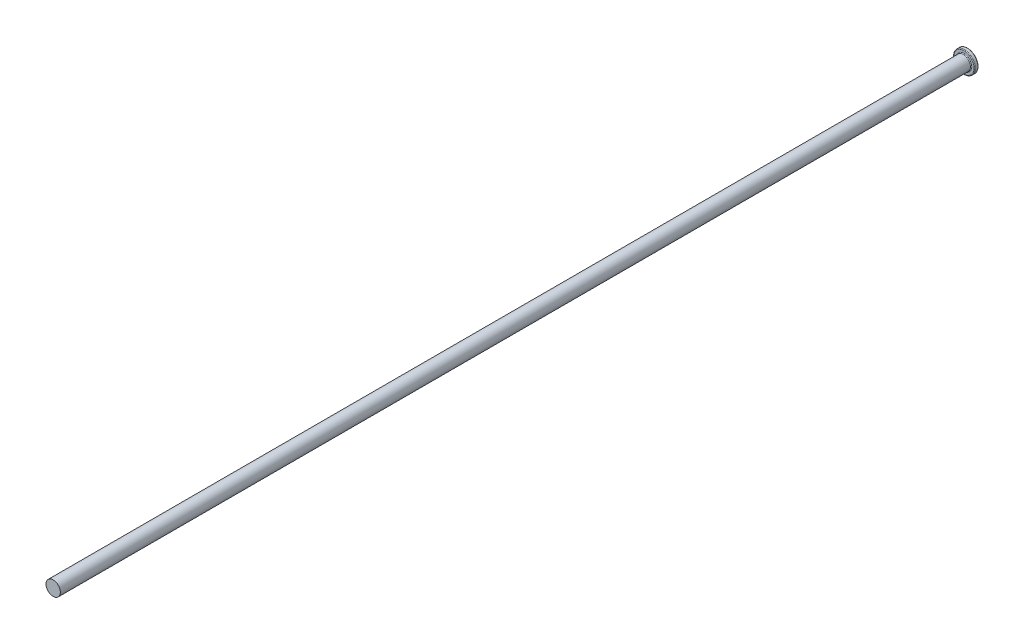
ISO-10303-21;
HEADER;
FILE_DESCRIPTION(('STEP AP214'),'2;1');
FILE_NAME('part.step','',(''),(''),'','','');
FILE_SCHEMA(('AUTOMOTIVE_DESIGN { 1 0 10303 214 1 1 1 1 }'));
ENDSEC;
DATA;
#1=APPLICATION_CONTEXT('core data for automotive mechanical design processes');
#2=APPLICATION_PROTOCOL_DEFINITION('international standard','automotive_design',2000,#1);
#3=PRODUCT_CONTEXT('',#1,'mechanical');
#4=PRODUCT('Part','Part','',(#3));
#5=PRODUCT_RELATED_PRODUCT_CATEGORY('part','',(#4));
#6=PRODUCT_DEFINITION_FORMATION('','',#4);
#7=PRODUCT_DEFINITION_CONTEXT('part definition',#1,'design');
#8=PRODUCT_DEFINITION('design','',#6,#7);
#9=PRODUCT_DEFINITION_SHAPE('','',#8);
#10=(LENGTH_UNIT() NAMED_UNIT(*) SI_UNIT(.MILLI.,.METRE.));
#11=(NAMED_UNIT(*) PLANE_ANGLE_UNIT() SI_UNIT($,.RADIAN.));
#12=(NAMED_UNIT(*) SI_UNIT($,.STERADIAN.) SOLID_ANGLE_UNIT());
#13=UNCERTAINTY_MEASURE_WITH_UNIT(LENGTH_MEASURE(1.E-05),#10,'distance_accuracy_value','');
#14=(GEOMETRIC_REPRESENTATION_CONTEXT(3) GLOBAL_UNCERTAINTY_ASSIGNED_CONTEXT((#13)) GLOBAL_UNIT_ASSIGNED_CONTEXT((#10,
#11,#12)) REPRESENTATION_CONTEXT('',''));
#15=CARTESIAN_POINT('',(0.,0.,0.));
#16=DIRECTION('',(0.,0.,1.));
#17=DIRECTION('',(1.,0.,0.));
#18=AXIS2_PLACEMENT_3D('',#15,#16,#17);
#19=CARTESIAN_POINT('',(0.,0.,127.));
#20=DIRECTION('',(0.,0.,-1.));
#21=DIRECTION('',(-1.,0.,0.));
#22=AXIS2_PLACEMENT_3D('',#19,#20,#21);
#23=CYLINDRICAL_SURFACE('',#22,1.);
#24=CARTESIAN_POINT('',(0.,0.,0.099999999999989));
#25=DIRECTION('',(0.,0.,-1.));
#26=DIRECTION('',(-1.,0.,0.));
#27=AXIS2_PLACEMENT_3D('',#24,#25,#26);
#28=CIRCLE('',#27,1.);
#29=CARTESIAN_POINT('',(-1.,0.,0.099999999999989));
#30=VERTEX_POINT('',#29);
#31=EDGE_CURVE('E71',#30,#30,#28,.F.);
#32=ORIENTED_EDGE('',*,*,#31,.T.);
#33=EDGE_LOOP('',(#32));
#34=FACE_BOUND('',#33,.T.);
#35=CARTESIAN_POINT('',(0.,0.,127.));
#36=DIRECTION('',(0.,0.,1.));
#37=DIRECTION('',(1.,0.,0.));
#38=AXIS2_PLACEMENT_3D('',#35,#36,#37);
#39=CIRCLE('',#38,1.);
#40=CARTESIAN_POINT('',(1.,0.,127.));
#41=VERTEX_POINT('',#40);
#42=EDGE_CURVE('E75',#41,#41,#39,.T.);
#43=ORIENTED_EDGE('',*,*,#42,.F.);
#44=EDGE_LOOP('',(#43));
#45=FACE_BOUND('',#44,.T.);
#46=ADVANCED_FACE('F43',(#34,#45),#23,.T.);
#47=CARTESIAN_POINT('',(0.,0.,127.));
#48=DIRECTION('',(0.,0.,1.));
#49=DIRECTION('',(1.,0.,0.));
#50=AXIS2_PLACEMENT_3D('',#47,#48,#49);
#51=PLANE('',#50);
#52=ORIENTED_EDGE('',*,*,#42,.T.);
#53=EDGE_LOOP('',(#52));
#54=FACE_BOUND('',#53,.T.);
#55=ADVANCED_FACE('F80',(#54),#51,.T.);
#56=CARTESIAN_POINT('',(0.,0.,-0.5));
#57=DIRECTION('',(0.,0.,1.));
#58=DIRECTION('',(1.,0.,0.));
#59=AXIS2_PLACEMENT_3D('',#56,#57,#58);
#60=CYLINDRICAL_SURFACE('',#59,1.5);
#61=CARTESIAN_POINT('',(0.,0.,-0.45));
#62=DIRECTION('',(0.,0.,-1.));
#63=DIRECTION('',(-1.,0.,0.));
#64=AXIS2_PLACEMENT_3D('',#61,#62,#63);
#65=CIRCLE('',#64,1.5);
#66=CARTESIAN_POINT('',(-1.5,0.,-0.45));
#67=VERTEX_POINT('',#66);
#68=EDGE_CURVE('E10',#67,#67,#65,.F.);
#69=ORIENTED_EDGE('',*,*,#68,.T.);
#70=EDGE_LOOP('',(#69));
#71=FACE_BOUND('',#70,.T.);
#72=CARTESIAN_POINT('',(0.,0.,-0.1));
#73=DIRECTION('',(0.,0.,-1.));
#74=DIRECTION('',(-1.,0.,0.));
#75=AXIS2_PLACEMENT_3D('',#72,#73,#74);
#76=CIRCLE('',#75,1.5);
#77=CARTESIAN_POINT('',(-1.5,0.,-0.1));
#78=VERTEX_POINT('',#77);
#79=EDGE_CURVE('E61',#78,#78,#76,.T.);
#80=ORIENTED_EDGE('',*,*,#79,.T.);
#81=EDGE_LOOP('',(#80));
#82=FACE_BOUND('',#81,.T.);
#83=ADVANCED_FACE('F89',(#71,#82),#60,.T.);
#84=CARTESIAN_POINT('',(0.,0.,-0.5));
#85=DIRECTION('',(0.,0.,-1.));
#86=DIRECTION('',(-1.,0.,0.));
#87=AXIS2_PLACEMENT_3D('',#84,#85,#86);
#88=PLANE('',#87);
#89=CARTESIAN_POINT('',(0.,0.,-0.5));
#90=DIRECTION('',(0.,0.,-1.));
#91=DIRECTION('',(-1.,0.,0.));
#92=AXIS2_PLACEMENT_3D('',#89,#90,#91);
#93=CIRCLE('',#92,1.45);
#94=CARTESIAN_POINT('',(-1.45,0.,-0.5));
#95=VERTEX_POINT('',#94);
#96=EDGE_CURVE('E51',#95,#95,#93,.T.);
#97=ORIENTED_EDGE('',*,*,#96,.T.);
#98=EDGE_LOOP('',(#97));
#99=FACE_BOUND('',#98,.T.);
#100=ADVANCED_FACE('F109',(#99),#88,.T.);
#101=CARTESIAN_POINT('',(0.,0.,0.));
#102=DIRECTION('',(0.,0.,-1.));
#103=DIRECTION('',(-1.,0.,0.));
#104=AXIS2_PLACEMENT_3D('',#101,#102,#103);
#105=PLANE('',#104);
#106=CARTESIAN_POINT('',(0.,0.,0.));
#107=DIRECTION('',(0.,0.,-1.));
#108=DIRECTION('',(-1.,0.,0.));
#109=AXIS2_PLACEMENT_3D('',#106,#107,#108);
#110=CIRCLE('',#109,1.4);
#111=CARTESIAN_POINT('',(-1.4,0.,0.));
#112=VERTEX_POINT('',#111);
#113=EDGE_CURVE('E56',#112,#112,#110,.F.);
#114=ORIENTED_EDGE('',*,*,#113,.T.);
#115=EDGE_LOOP('',(#114));
#116=FACE_BOUND('',#115,.T.);
#117=CARTESIAN_POINT('',(0.,0.,0.));
#118=DIRECTION('',(0.,0.,-1.));
#119=DIRECTION('',(-1.,0.,0.));
#120=AXIS2_PLACEMENT_3D('',#117,#118,#119);
#121=CIRCLE('',#120,1.1);
#122=CARTESIAN_POINT('',(-1.1,0.,0.));
#123=VERTEX_POINT('',#122);
#124=EDGE_CURVE('E67',#123,#123,#121,.T.);
#125=ORIENTED_EDGE('',*,*,#124,.T.);
#126=EDGE_LOOP('',(#125));
#127=FACE_BOUND('',#126,.T.);
#128=ADVANCED_FACE('F95',(#116,#127),#105,.F.);
#129=CARTESIAN_POINT('',(0.,0.,0.099999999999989));
#130=DIRECTION('',(0.,0.,-1.));
#131=DIRECTION('',(-1.,0.,0.));
#132=AXIS2_PLACEMENT_3D('',#129,#130,#131);
#133=TOROIDAL_SURFACE('',#132,1.1,0.1);
#134=ORIENTED_EDGE('',*,*,#124,.F.);
#135=EDGE_LOOP('',(#134));
#136=FACE_BOUND('',#135,.T.);
#137=ORIENTED_EDGE('',*,*,#31,.F.);
#138=EDGE_LOOP('',(#137));
#139=FACE_BOUND('',#138,.T.);
#140=ADVANCED_FACE('F93',(#136,#139),#133,.F.);
#141=CARTESIAN_POINT('',(0.,0.,-0.1));
#142=DIRECTION('',(0.,0.,-1.));
#143=DIRECTION('',(-1.,0.,0.));
#144=AXIS2_PLACEMENT_3D('',#141,#142,#143);
#145=TOROIDAL_SURFACE('',#144,1.4,0.1);
#146=ORIENTED_EDGE('',*,*,#113,.F.);
#147=EDGE_LOOP('',(#146));
#148=FACE_BOUND('',#147,.T.);
#149=ORIENTED_EDGE('',*,*,#79,.F.);
#150=EDGE_LOOP('',(#149));
#151=FACE_BOUND('',#150,.T.);
#152=ADVANCED_FACE('F94',(#148,#151),#145,.T.);
#153=CARTESIAN_POINT('',(0.,0.,-0.45));
#154=DIRECTION('',(0.,0.,-1.));
#155=DIRECTION('',(-1.,0.,0.));
#156=AXIS2_PLACEMENT_3D('',#153,#154,#155);
#157=TOROIDAL_SURFACE('',#156,1.45,0.05);
#158=ORIENTED_EDGE('',*,*,#68,.F.);
#159=EDGE_LOOP('',(#158));
#160=FACE_BOUND('',#159,.T.);
#161=ORIENTED_EDGE('',*,*,#96,.F.);
#162=EDGE_LOOP('',(#161));
#163=FACE_BOUND('',#162,.T.);
#164=ADVANCED_FACE('F45',(#160,#163),#157,.T.);
#165=CLOSED_SHELL('',(#46,#55,#83,#100,#128,#140,#152,#164));
#166=MANIFOLD_SOLID_BREP('B2',#165);
#167=ADVANCED_BREP_SHAPE_REPRESENTATION('',(#18,#166),#14);
#168=SHAPE_DEFINITION_REPRESENTATION(#9,#167);
ENDSEC;
END-ISO-10303-21;
